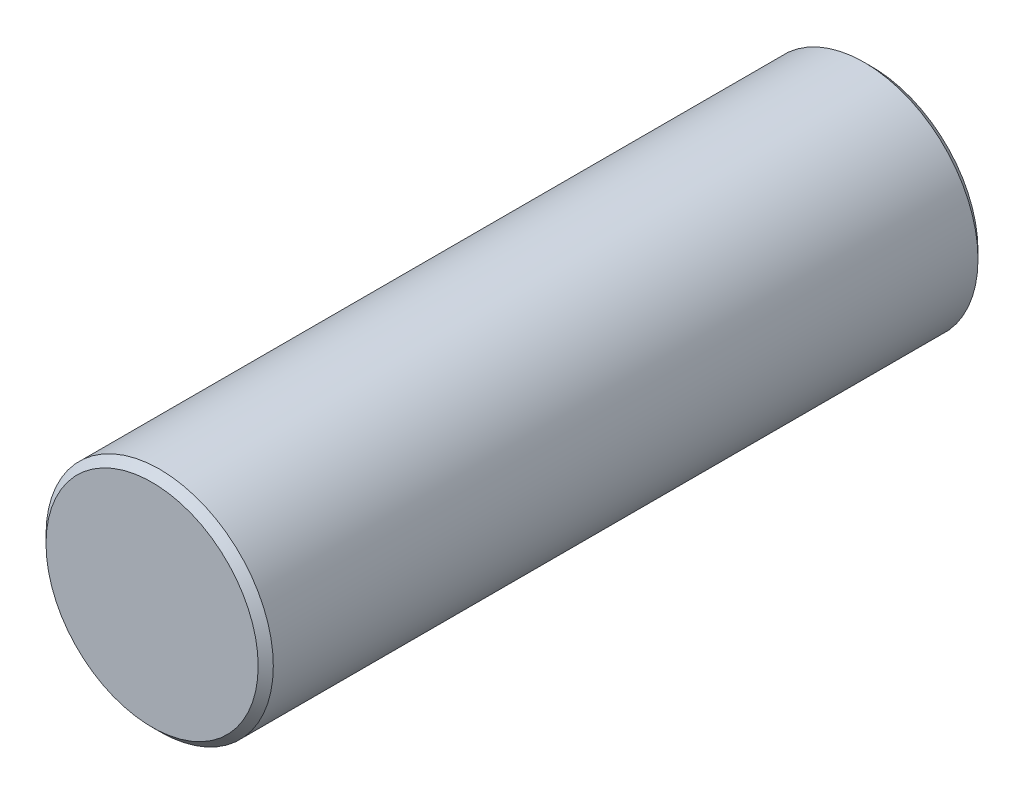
ISO-10303-21;
HEADER;
FILE_DESCRIPTION(('STEP AP214'),'2;1');
FILE_NAME('part.step','',(''),(''),'','','');
FILE_SCHEMA(('AUTOMOTIVE_DESIGN { 1 0 10303 214 1 1 1 1 }'));
ENDSEC;
DATA;
#1=APPLICATION_CONTEXT('core data for automotive mechanical design processes');
#2=APPLICATION_PROTOCOL_DEFINITION('international standard','automotive_design',2000,#1);
#3=PRODUCT_CONTEXT('',#1,'mechanical');
#4=PRODUCT('Part','Part','',(#3));
#5=PRODUCT_RELATED_PRODUCT_CATEGORY('part','',(#4));
#6=PRODUCT_DEFINITION_FORMATION('','',#4);
#7=PRODUCT_DEFINITION_CONTEXT('part definition',#1,'design');
#8=PRODUCT_DEFINITION('design','',#6,#7);
#9=PRODUCT_DEFINITION_SHAPE('','',#8);
#10=(LENGTH_UNIT() NAMED_UNIT(*) SI_UNIT(.MILLI.,.METRE.));
#11=(NAMED_UNIT(*) PLANE_ANGLE_UNIT() SI_UNIT($,.RADIAN.));
#12=(NAMED_UNIT(*) SI_UNIT($,.STERADIAN.) SOLID_ANGLE_UNIT());
#13=UNCERTAINTY_MEASURE_WITH_UNIT(LENGTH_MEASURE(1.E-05),#10,'distance_accuracy_value','');
#14=(GEOMETRIC_REPRESENTATION_CONTEXT(3) GLOBAL_UNCERTAINTY_ASSIGNED_CONTEXT((#13)) GLOBAL_UNIT_ASSIGNED_CONTEXT((#10,
#11,#12)) REPRESENTATION_CONTEXT('',''));
#15=CARTESIAN_POINT('',(0.,0.,0.));
#16=DIRECTION('',(0.,0.,1.));
#17=DIRECTION('',(1.,0.,0.));
#18=AXIS2_PLACEMENT_3D('',#15,#16,#17);
#19=CARTESIAN_POINT('',(0.,0.,4.75));
#20=DIRECTION('',(0.,0.,-1.));
#21=DIRECTION('',(-1.,0.,0.));
#22=AXIS2_PLACEMENT_3D('',#19,#20,#21);
#23=CYLINDRICAL_SURFACE('',#22,1.5);
#24=CARTESIAN_POINT('',(0.,0.,-4.65));
#25=DIRECTION('',(0.,0.,1.));
#26=DIRECTION('',(1.,0.,0.));
#27=AXIS2_PLACEMENT_3D('',#24,#25,#26);
#28=CIRCLE('',#27,1.5);
#29=CARTESIAN_POINT('',(-1.5,0.,-4.65));
#30=VERTEX_POINT('',#29);
#31=EDGE_CURVE('E38',#30,#30,#28,.T.);
#32=CARTESIAN_POINT('',(0.,0.,4.65));
#33=DIRECTION('',(0.,0.,1.));
#34=DIRECTION('',(1.,0.,0.));
#35=AXIS2_PLACEMENT_3D('',#32,#33,#34);
#36=CIRCLE('',#35,1.5);
#37=CARTESIAN_POINT('',(-1.5,0.,4.65));
#38=VERTEX_POINT('',#37);
#39=EDGE_CURVE('E42',#38,#38,#36,.F.);
#40=CARTESIAN_POINT('',(-1.5,0.,-4.65));
#41=CARTESIAN_POINT('',(-1.5,0.,-4.553125));
#42=CARTESIAN_POINT('',(-1.5,0.,-4.45625));
#43=CARTESIAN_POINT('',(-1.5,0.,-4.2625));
#44=CARTESIAN_POINT('',(-1.5,0.,-4.165625));
#45=CARTESIAN_POINT('',(-1.5,0.,-3.971875));
#46=CARTESIAN_POINT('',(-1.5,0.,-3.875));
#47=CARTESIAN_POINT('',(-1.5,0.,-3.68125));
#48=CARTESIAN_POINT('',(-1.5,0.,-3.584375));
#49=CARTESIAN_POINT('',(-1.5,0.,-3.390625));
#50=CARTESIAN_POINT('',(-1.5,0.,-3.29375));
#51=CARTESIAN_POINT('',(-1.5,0.,-3.1));
#52=CARTESIAN_POINT('',(-1.5,0.,-3.003125));
#53=CARTESIAN_POINT('',(-1.5,0.,-2.809375));
#54=CARTESIAN_POINT('',(-1.5,0.,-2.7125));
#55=CARTESIAN_POINT('',(-1.5,0.,-2.51875));
#56=CARTESIAN_POINT('',(-1.5,0.,-2.421875));
#57=CARTESIAN_POINT('',(-1.5,0.,-2.228125));
#58=CARTESIAN_POINT('',(-1.5,0.,-2.13125));
#59=CARTESIAN_POINT('',(-1.5,0.,-1.9375));
#60=CARTESIAN_POINT('',(-1.5,0.,-1.840625));
#61=CARTESIAN_POINT('',(-1.5,0.,-1.646875));
#62=CARTESIAN_POINT('',(-1.5,0.,-1.55));
#63=CARTESIAN_POINT('',(-1.5,0.,-1.35625));
#64=CARTESIAN_POINT('',(-1.5,0.,-1.259375));
#65=CARTESIAN_POINT('',(-1.5,0.,-1.065625));
#66=CARTESIAN_POINT('',(-1.5,0.,-0.968750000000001));
#67=CARTESIAN_POINT('',(-1.5,0.,-0.775000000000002));
#68=CARTESIAN_POINT('',(-1.5,0.,-0.678125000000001));
#69=CARTESIAN_POINT('',(-1.5,0.,-0.484375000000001));
#70=CARTESIAN_POINT('',(-1.5,0.,-0.387500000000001));
#71=CARTESIAN_POINT('',(-1.5,0.,-0.193750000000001));
#72=CARTESIAN_POINT('',(-1.5,0.,-0.0968750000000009));
#73=CARTESIAN_POINT('',(-1.5,0.,0.0968749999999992));
#74=CARTESIAN_POINT('',(-1.5,0.,0.193749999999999));
#75=CARTESIAN_POINT('',(-1.5,0.,0.387499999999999));
#76=CARTESIAN_POINT('',(-1.5,0.,0.484374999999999));
#77=CARTESIAN_POINT('',(-1.5,0.,0.678124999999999));
#78=CARTESIAN_POINT('',(-1.5,0.,0.774999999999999));
#79=CARTESIAN_POINT('',(-1.5,0.,0.968749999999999));
#80=CARTESIAN_POINT('',(-1.5,0.,1.065625));
#81=CARTESIAN_POINT('',(-1.5,0.,1.259375));
#82=CARTESIAN_POINT('',(-1.5,0.,1.35625));
#83=CARTESIAN_POINT('',(-1.5,0.,1.55));
#84=CARTESIAN_POINT('',(-1.5,0.,1.646875));
#85=CARTESIAN_POINT('',(-1.5,0.,1.840625));
#86=CARTESIAN_POINT('',(-1.5,0.,1.9375));
#87=CARTESIAN_POINT('',(-1.5,0.,2.13125));
#88=CARTESIAN_POINT('',(-1.5,0.,2.228125));
#89=CARTESIAN_POINT('',(-1.5,0.,2.421875));
#90=CARTESIAN_POINT('',(-1.5,0.,2.51875));
#91=CARTESIAN_POINT('',(-1.5,0.,2.7125));
#92=CARTESIAN_POINT('',(-1.5,0.,2.809375));
#93=CARTESIAN_POINT('',(-1.5,0.,3.003125));
#94=CARTESIAN_POINT('',(-1.5,0.,3.1));
#95=CARTESIAN_POINT('',(-1.5,0.,3.29375));
#96=CARTESIAN_POINT('',(-1.5,0.,3.390625));
#97=CARTESIAN_POINT('',(-1.5,0.,3.584375));
#98=CARTESIAN_POINT('',(-1.5,0.,3.68125));
#99=CARTESIAN_POINT('',(-1.5,0.,3.875));
#100=CARTESIAN_POINT('',(-1.5,0.,3.971875));
#101=CARTESIAN_POINT('',(-1.5,0.,4.165625));
#102=CARTESIAN_POINT('',(-1.5,0.,4.2625));
#103=CARTESIAN_POINT('',(-1.5,0.,4.45625));
#104=CARTESIAN_POINT('',(-1.5,0.,4.553125));
#105=CARTESIAN_POINT('',(-1.5,0.,4.65));
#106=B_SPLINE_CURVE_WITH_KNOTS('',3,(#40,#41,#42,#43,#44,#45,#46,#47,#48,#49,#50,#51,#52,#53,
#54,#55,#56,#57,#58,#59,#60,#61,#62,#63,#64,#65,#66,#67,#68,#69,#70,#71,#72,#73,#74,#75,#76,#77,
#78,#79,#80,#81,#82,#83,#84,#85,#86,#87,#88,#89,#90,#91,#92,#93,#94,#95,#96,#97,#98,#99,#100,
#101,#102,#103,#104,#105),.UNSPECIFIED.,.F.,.F.,(4,2,2,2,2,2,2,2,2,2,2,2,2,2,2,2,2,2,2,2,2,2,2,
2,2,2,2,2,2,2,2,2,4),(0.,0.290625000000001,0.58125,0.871875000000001,1.1625,1.453125,1.74375,
2.034375,2.325,2.615625,2.90625,3.196875,3.4875,3.778125,4.06875,4.359375,4.65,4.940625,5.23125,
5.521875,5.8125,6.103125,6.39375,6.684375,6.975,7.265625,7.55625,7.846875,8.1375,8.428125,
8.71875,9.009375,9.3),.UNSPECIFIED.);
#107=EDGE_CURVE('BSEAM28',#30,#38,#106,.T.);
#108=ORIENTED_EDGE('',*,*,#31,.T.);
#109=ORIENTED_EDGE('',*,*,#39,.T.);
#110=ORIENTED_EDGE('',*,*,#107,.T.);
#111=ORIENTED_EDGE('',*,*,#107,.F.);
#112=EDGE_LOOP('',(#108,#110,#109,#111));
#113=FACE_BOUND('',#112,.T.);
#114=ADVANCED_FACE('F28',(#113),#23,.T.);
#115=CARTESIAN_POINT('',(0.,0.,4.75));
#116=DIRECTION('',(0.,0.,1.));
#117=DIRECTION('',(1.,0.,0.));
#118=AXIS2_PLACEMENT_3D('',#115,#116,#117);
#119=PLANE('',#118);
#120=CARTESIAN_POINT('',(0.,0.,4.75));
#121=DIRECTION('',(0.,0.,1.));
#122=DIRECTION('',(1.,0.,0.));
#123=AXIS2_PLACEMENT_3D('',#120,#121,#122);
#124=CIRCLE('',#123,1.4);
#125=CARTESIAN_POINT('',(-1.4,0.,4.75));
#126=VERTEX_POINT('',#125);
#127=EDGE_CURVE('E10',#126,#126,#124,.T.);
#128=ORIENTED_EDGE('',*,*,#127,.T.);
#129=EDGE_LOOP('',(#128));
#130=FACE_BOUND('',#129,.T.);
#131=ADVANCED_FACE('F61',(#130),#119,.T.);
#132=CARTESIAN_POINT('',(0.,0.,-4.75));
#133=DIRECTION('',(0.,0.,1.));
#134=DIRECTION('',(1.,0.,0.));
#135=AXIS2_PLACEMENT_3D('',#132,#133,#134);
#136=PLANE('',#135);
#137=CARTESIAN_POINT('',(0.,0.,-4.75));
#138=DIRECTION('',(0.,0.,1.));
#139=DIRECTION('',(1.,0.,0.));
#140=AXIS2_PLACEMENT_3D('',#137,#138,#139);
#141=CIRCLE('',#140,1.4);
#142=CARTESIAN_POINT('',(1.4,0.,-4.75));
#143=VERTEX_POINT('',#142);
#144=EDGE_CURVE('E34',#143,#143,#141,.F.);
#145=ORIENTED_EDGE('',*,*,#144,.T.);
#146=EDGE_LOOP('',(#145));
#147=FACE_BOUND('',#146,.T.);
#148=ADVANCED_FACE('F57',(#147),#136,.F.);
#149=CARTESIAN_POINT('',(0.,0.,-4.65));
#150=DIRECTION('',(0.,0.,1.));
#151=DIRECTION('',(1.,0.,0.));
#152=AXIS2_PLACEMENT_3D('',#149,#150,#151);
#153=CONICAL_SURFACE('',#152,1.5,0.785398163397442);
#154=ORIENTED_EDGE('',*,*,#144,.F.);
#155=EDGE_LOOP('',(#154));
#156=FACE_BOUND('',#155,.T.);
#157=ORIENTED_EDGE('',*,*,#31,.F.);
#158=EDGE_LOOP('',(#157));
#159=FACE_BOUND('',#158,.T.);
#160=ADVANCED_FACE('F52',(#156,#159),#153,.T.);
#161=CARTESIAN_POINT('',(0.,0.,4.75));
#162=DIRECTION('',(0.,0.,-1.));
#163=DIRECTION('',(-1.,0.,0.));
#164=AXIS2_PLACEMENT_3D('',#161,#162,#163);
#165=CONICAL_SURFACE('',#164,1.4,0.785398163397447);
#166=CARTESIAN_POINT('',(-1.5,0.,4.65));
#167=CARTESIAN_POINT('',(-1.49895833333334,0.,4.65104166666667));
#168=CARTESIAN_POINT('',(-1.49791666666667,0.,4.65208333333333));
#169=CARTESIAN_POINT('',(-1.49583333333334,0.,4.65416666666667));
#170=CARTESIAN_POINT('',(-1.49479166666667,0.,4.65520833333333));
#171=CARTESIAN_POINT('',(-1.49270833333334,0.,4.65729166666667));
#172=CARTESIAN_POINT('',(-1.49166666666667,0.,4.65833333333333));
#173=CARTESIAN_POINT('',(-1.48958333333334,0.,4.66041666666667));
#174=CARTESIAN_POINT('',(-1.48854166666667,0.,4.66145833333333));
#175=CARTESIAN_POINT('',(-1.48645833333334,0.,4.66354166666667));
#176=CARTESIAN_POINT('',(-1.48541666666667,0.,4.66458333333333));
#177=CARTESIAN_POINT('',(-1.48333333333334,0.,4.66666666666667));
#178=CARTESIAN_POINT('',(-1.48229166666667,0.,4.66770833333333));
#179=CARTESIAN_POINT('',(-1.48020833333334,0.,4.66979166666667));
#180=CARTESIAN_POINT('',(-1.47916666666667,0.,4.67083333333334));
#181=CARTESIAN_POINT('',(-1.47708333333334,0.,4.67291666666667));
#182=CARTESIAN_POINT('',(-1.47604166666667,0.,4.67395833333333));
#183=CARTESIAN_POINT('',(-1.47395833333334,0.,4.67604166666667));
#184=CARTESIAN_POINT('',(-1.47291666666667,0.,4.67708333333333));
#185=CARTESIAN_POINT('',(-1.47083333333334,0.,4.67916666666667));
#186=CARTESIAN_POINT('',(-1.46979166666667,0.,4.68020833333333));
#187=CARTESIAN_POINT('',(-1.46770833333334,0.,4.68229166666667));
#188=CARTESIAN_POINT('',(-1.46666666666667,0.,4.68333333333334));
#189=CARTESIAN_POINT('',(-1.46458333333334,0.,4.68541666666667));
#190=CARTESIAN_POINT('',(-1.46354166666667,0.,4.68645833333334));
#191=CARTESIAN_POINT('',(-1.46145833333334,0.,4.68854166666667));
#192=CARTESIAN_POINT('',(-1.46041666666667,0.,4.68958333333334));
#193=CARTESIAN_POINT('',(-1.45833333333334,0.,4.69166666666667));
#194=CARTESIAN_POINT('',(-1.45729166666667,0.,4.69270833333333));
#195=CARTESIAN_POINT('',(-1.45520833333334,0.,4.69479166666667));
#196=CARTESIAN_POINT('',(-1.45416666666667,0.,4.69583333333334));
#197=CARTESIAN_POINT('',(-1.45208333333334,0.,4.69791666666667));
#198=CARTESIAN_POINT('',(-1.45104166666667,0.,4.69895833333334));
#199=CARTESIAN_POINT('',(-1.44895833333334,0.,4.70104166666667));
#200=CARTESIAN_POINT('',(-1.44791666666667,0.,4.70208333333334));
#201=CARTESIAN_POINT('',(-1.44583333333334,0.,4.70416666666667));
#202=CARTESIAN_POINT('',(-1.44479166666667,0.,4.70520833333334));
#203=CARTESIAN_POINT('',(-1.44270833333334,0.,4.70729166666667));
#204=CARTESIAN_POINT('',(-1.44166666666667,0.,4.70833333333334));
#205=CARTESIAN_POINT('',(-1.43958333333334,0.,4.71041666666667));
#206=CARTESIAN_POINT('',(-1.43854166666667,0.,4.71145833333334));
#207=CARTESIAN_POINT('',(-1.43645833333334,0.,4.71354166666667));
#208=CARTESIAN_POINT('',(-1.43541666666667,0.,4.71458333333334));
#209=CARTESIAN_POINT('',(-1.43333333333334,0.,4.71666666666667));
#210=CARTESIAN_POINT('',(-1.43229166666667,0.,4.71770833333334));
#211=CARTESIAN_POINT('',(-1.43020833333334,0.,4.71979166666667));
#212=CARTESIAN_POINT('',(-1.42916666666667,0.,4.72083333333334));
#213=CARTESIAN_POINT('',(-1.42708333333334,0.,4.72291666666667));
#214=CARTESIAN_POINT('',(-1.42604166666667,0.,4.72395833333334));
#215=CARTESIAN_POINT('',(-1.42395833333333,0.,4.72604166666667));
#216=CARTESIAN_POINT('',(-1.42291666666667,0.,4.72708333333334));
#217=CARTESIAN_POINT('',(-1.42083333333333,0.,4.72916666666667));
#218=CARTESIAN_POINT('',(-1.41979166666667,0.,4.73020833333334));
#219=CARTESIAN_POINT('',(-1.41770833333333,0.,4.73229166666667));
#220=CARTESIAN_POINT('',(-1.41666666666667,0.,4.73333333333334));
#221=CARTESIAN_POINT('',(-1.41458333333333,0.,4.73541666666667));
#222=CARTESIAN_POINT('',(-1.41354166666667,0.,4.73645833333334));
#223=CARTESIAN_POINT('',(-1.41145833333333,0.,4.73854166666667));
#224=CARTESIAN_POINT('',(-1.41041666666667,0.,4.73958333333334));
#225=CARTESIAN_POINT('',(-1.40833333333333,0.,4.74166666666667));
#226=CARTESIAN_POINT('',(-1.40729166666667,0.,4.74270833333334));
#227=CARTESIAN_POINT('',(-1.40520833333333,0.,4.74479166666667));
#228=CARTESIAN_POINT('',(-1.40416666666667,0.,4.74583333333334));
#229=CARTESIAN_POINT('',(-1.40208333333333,0.,4.74791666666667));
#230=CARTESIAN_POINT('',(-1.40104166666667,0.,4.74895833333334));
#231=CARTESIAN_POINT('',(-1.4,0.,4.75));
#232=B_SPLINE_CURVE_WITH_KNOTS('',3,(#166,#167,#168,#169,#170,#171,#172,#173,#174,#175,#176,
#177,#178,#179,#180,#181,#182,#183,#184,#185,#186,#187,#188,#189,#190,#191,#192,#193,#194,#195,
#196,#197,#198,#199,#200,#201,#202,#203,#204,#205,#206,#207,#208,#209,#210,#211,#212,#213,#214,
#215,#216,#217,#218,#219,#220,#221,#222,#223,#224,#225,#226,#227,#228,#229,#230,#231),
.UNSPECIFIED.,.F.,.F.,(4,2,2,2,2,2,2,2,2,2,2,2,2,2,2,2,2,2,2,2,2,2,2,2,2,2,2,2,2,2,2,2,4),(0.,
0.00441941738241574,0.00883883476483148,0.0132582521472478,0.0176776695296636,
0.0220970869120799,0.0265165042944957,0.030935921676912,0.0353553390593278,0.0397747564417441,
0.0441941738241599,0.0486135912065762,0.0530330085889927,0.0574524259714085,0.0618718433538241,
0.0662912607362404,0.0707106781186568,0.0751300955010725,0.0795495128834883,0.0839689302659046,
0.0883883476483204,0.0928077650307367,0.0972271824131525,0.101646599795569,0.106066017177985,
0.110485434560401,0.114904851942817,0.119324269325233,0.123743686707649,0.128163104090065,
0.132582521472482,0.137001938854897,0.141421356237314),.UNSPECIFIED.);
#233=EDGE_CURVE('BSEAM49',#38,#126,#232,.T.);
#234=ORIENTED_EDGE('',*,*,#39,.F.);
#235=ORIENTED_EDGE('',*,*,#127,.F.);
#236=ORIENTED_EDGE('',*,*,#233,.T.);
#237=ORIENTED_EDGE('',*,*,#233,.F.);
#238=EDGE_LOOP('',(#234,#236,#235,#237));
#239=FACE_BOUND('',#238,.T.);
#240=ADVANCED_FACE('F49',(#239),#165,.T.);
#241=CLOSED_SHELL('',(#114,#131,#148,#160,#240));
#242=MANIFOLD_SOLID_BREP('B2',#241);
#243=ADVANCED_BREP_SHAPE_REPRESENTATION('',(#18,#242),#14);
#244=SHAPE_DEFINITION_REPRESENTATION(#9,#243);
ENDSEC;
END-ISO-10303-21;
